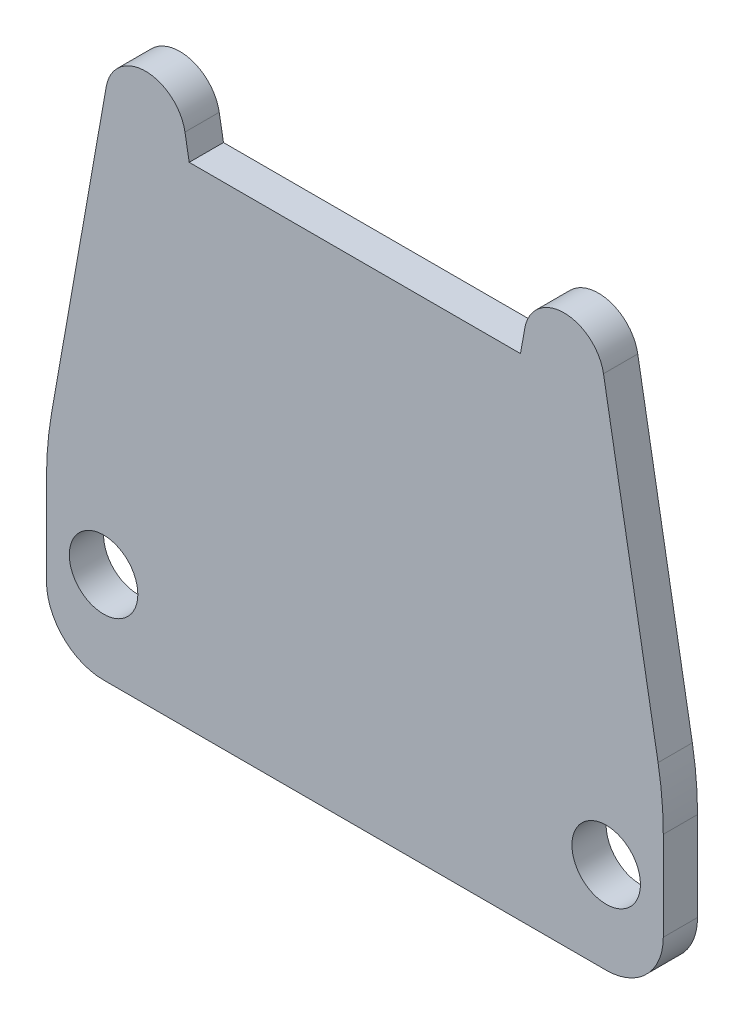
ISO-10303-21;
HEADER;
FILE_DESCRIPTION(('STEP AP214'),'2;1');
FILE_NAME('part.step','',(''),(''),'','','');
FILE_SCHEMA(('AUTOMOTIVE_DESIGN { 1 0 10303 214 1 1 1 1 }'));
ENDSEC;
DATA;
#1=APPLICATION_CONTEXT('core data for automotive mechanical design processes');
#2=APPLICATION_PROTOCOL_DEFINITION('international standard','automotive_design',2000,#1);
#3=PRODUCT_CONTEXT('',#1,'mechanical');
#4=PRODUCT('Part','Part','',(#3));
#5=PRODUCT_RELATED_PRODUCT_CATEGORY('part','',(#4));
#6=PRODUCT_DEFINITION_FORMATION('','',#4);
#7=PRODUCT_DEFINITION_CONTEXT('part definition',#1,'design');
#8=PRODUCT_DEFINITION('design','',#6,#7);
#9=PRODUCT_DEFINITION_SHAPE('','',#8);
#10=(LENGTH_UNIT() NAMED_UNIT(*) SI_UNIT(.MILLI.,.METRE.));
#11=(NAMED_UNIT(*) PLANE_ANGLE_UNIT() SI_UNIT($,.RADIAN.));
#12=(NAMED_UNIT(*) SI_UNIT($,.STERADIAN.) SOLID_ANGLE_UNIT());
#13=UNCERTAINTY_MEASURE_WITH_UNIT(LENGTH_MEASURE(1.E-05),#10,'distance_accuracy_value','');
#14=(GEOMETRIC_REPRESENTATION_CONTEXT(3) GLOBAL_UNCERTAINTY_ASSIGNED_CONTEXT((#13)) GLOBAL_UNIT_ASSIGNED_CONTEXT((#10,
#11,#12)) REPRESENTATION_CONTEXT('',''));
#15=CARTESIAN_POINT('',(0.,0.,0.));
#16=DIRECTION('',(0.,0.,1.));
#17=DIRECTION('',(1.,0.,0.));
#18=AXIS2_PLACEMENT_3D('',#15,#16,#17);
#19=CARTESIAN_POINT('',(-22.,14.8090097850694,3.));
#20=DIRECTION('',(0.,0.,1.));
#21=DIRECTION('',(1.,0.,0.));
#22=AXIS2_PLACEMENT_3D('',#19,#20,#21);
#23=PLANE('',#22);
#24=CARTESIAN_POINT('',(0.,0.,3.));
#25=DIRECTION('',(0.,0.,1.));
#26=DIRECTION('',(1.,0.,0.));
#27=AXIS2_PLACEMENT_3D('',#24,#25,#26);
#28=CIRCLE('',#27,3.);
#29=CARTESIAN_POINT('',(3.,0.,3.));
#30=VERTEX_POINT('',#29);
#31=EDGE_CURVE('E139',#30,#30,#28,.F.);
#32=ORIENTED_EDGE('',*,*,#31,.T.);
#33=EDGE_LOOP('',(#32));
#34=FACE_BOUND('',#33,.T.);
#35=CARTESIAN_POINT('',(-44.,0.,3.));
#36=DIRECTION('',(0.,0.,1.));
#37=DIRECTION('',(1.,0.,0.));
#38=AXIS2_PLACEMENT_3D('',#35,#36,#37);
#39=CIRCLE('',#38,3.);
#40=CARTESIAN_POINT('',(-41.,0.,3.));
#41=VERTEX_POINT('',#40);
#42=EDGE_CURVE('E146',#41,#41,#39,.F.);
#43=ORIENTED_EDGE('',*,*,#42,.T.);
#44=EDGE_LOOP('',(#43));
#45=FACE_BOUND('',#44,.T.);
#46=CARTESIAN_POINT('',(-25.0000007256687,4.80420494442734,3.));
#47=DIRECTION('',(0.,0.,1.));
#48=DIRECTION('',(1.,0.,0.));
#49=AXIS2_PLACEMENT_3D('',#46,#47,#48);
#50=CIRCLE('',#49,30.0000007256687);
#51=CARTESIAN_POINT('',(4.54423258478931,10.0136503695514,3.));
#52=VERTEX_POINT('',#51);
#53=CARTESIAN_POINT('',(4.99999999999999,4.80420494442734,3.));
#54=VERTEX_POINT('',#53);
#55=EDGE_CURVE('E194',#52,#54,#50,.F.);
#56=ORIENTED_EDGE('',*,*,#55,.F.);
#57=DIRECTION('',(-0.173648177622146,0.984807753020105,0.));
#58=VECTOR('',#57,1.);
#59=CARTESIAN_POINT('',(-0.233191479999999,37.10776862,3.));
#60=LINE('',#59,#58);
#61=CARTESIAN_POINT('',(-0.233191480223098,37.1077686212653,3.));
#62=VERTEX_POINT('',#61);
#63=EDGE_CURVE('E191',#62,#52,#60,.F.);
#64=ORIENTED_EDGE('',*,*,#63,.F.);
#65=CARTESIAN_POINT('',(-3.680018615,36.5000000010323,3.));
#66=DIRECTION('',(0.,0.,1.));
#67=DIRECTION('',(1.,0.,0.));
#68=AXIS2_PLACEMENT_3D('',#65,#66,#67);
#69=CIRCLE('',#68,3.49999999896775);
#70=CARTESIAN_POINT('',(-7.12684574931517,37.1077686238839,3.));
#71=VERTEX_POINT('',#70);
#72=EDGE_CURVE('E188',#71,#62,#69,.F.);
#73=ORIENTED_EDGE('',*,*,#72,.F.);
#74=DIRECTION('',(-0.173648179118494,-0.984807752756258,0.));
#75=VECTOR('',#74,1.);
#76=CARTESIAN_POINT('',(-7.49850223,35.,3.));
#77=LINE('',#76,#75);
#78=CARTESIAN_POINT('',(-7.49850223,35.,3.));
#79=VERTEX_POINT('',#78);
#80=EDGE_CURVE('E180',#79,#71,#77,.F.);
#81=ORIENTED_EDGE('',*,*,#80,.F.);
#82=DIRECTION('',(1.,0.,0.));
#83=VECTOR('',#82,1.);
#84=CARTESIAN_POINT('',(-36.50149777,35.,3.));
#85=LINE('',#84,#83);
#86=CARTESIAN_POINT('',(-36.50149777,35.,3.));
#87=VERTEX_POINT('',#86);
#88=EDGE_CURVE('E144',#87,#79,#85,.T.);
#89=ORIENTED_EDGE('',*,*,#88,.F.);
#90=DIRECTION('',(-0.173648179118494,0.984807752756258,0.));
#91=VECTOR('',#90,1.);
#92=CARTESIAN_POINT('',(-36.87315425,37.10776862,3.));
#93=LINE('',#92,#91);
#94=CARTESIAN_POINT('',(-36.8731542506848,37.1077686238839,3.));
#95=VERTEX_POINT('',#94);
#96=EDGE_CURVE('E118',#95,#87,#93,.F.);
#97=ORIENTED_EDGE('',*,*,#96,.F.);
#98=CARTESIAN_POINT('',(-40.319981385,36.5000000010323,3.));
#99=DIRECTION('',(0.,0.,1.));
#100=DIRECTION('',(1.,0.,0.));
#101=AXIS2_PLACEMENT_3D('',#98,#99,#100);
#102=CIRCLE('',#101,3.49999999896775);
#103=CARTESIAN_POINT('',(-43.7668085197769,37.1077686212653,3.));
#104=VERTEX_POINT('',#103);
#105=EDGE_CURVE('E20',#104,#95,#102,.F.);
#106=ORIENTED_EDGE('',*,*,#105,.F.);
#107=DIRECTION('',(-0.173648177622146,-0.984807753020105,0.));
#108=VECTOR('',#107,1.);
#109=CARTESIAN_POINT('',(-48.54423259,10.01365034,3.));
#110=LINE('',#109,#108);
#111=CARTESIAN_POINT('',(-48.5442325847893,10.0136503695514,3.));
#112=VERTEX_POINT('',#111);
#113=EDGE_CURVE('E107',#112,#104,#110,.F.);
#114=ORIENTED_EDGE('',*,*,#113,.F.);
#115=CARTESIAN_POINT('',(-18.9999992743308,4.80420494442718,3.));
#116=DIRECTION('',(0.,0.,1.));
#117=DIRECTION('',(1.,0.,0.));
#118=AXIS2_PLACEMENT_3D('',#115,#116,#117);
#119=CIRCLE('',#118,30.0000007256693);
#120=CARTESIAN_POINT('',(-49.,4.80420497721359,3.));
#121=VERTEX_POINT('',#120);
#122=EDGE_CURVE('E212',#121,#112,#119,.F.);
#123=ORIENTED_EDGE('',*,*,#122,.F.);
#124=DIRECTION('',(0.,1.,0.));
#125=VECTOR('',#124,1.);
#126=CARTESIAN_POINT('',(-49.,-3.00000001,3.));
#127=LINE('',#126,#125);
#128=CARTESIAN_POINT('',(-49.,-3.00000001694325,3.));
#129=VERTEX_POINT('',#128);
#130=EDGE_CURVE('E209',#129,#121,#127,.T.);
#131=ORIENTED_EDGE('',*,*,#130,.F.);
#132=CARTESIAN_POINT('',(-44.0000000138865,-3.0000000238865,3.));
#133=DIRECTION('',(0.,0.,1.));
#134=DIRECTION('',(1.,0.,0.));
#135=AXIS2_PLACEMENT_3D('',#132,#133,#134);
#136=CIRCLE('',#135,4.99999998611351);
#137=CARTESIAN_POINT('',(-44.0000000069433,-8.00000001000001,3.));
#138=VERTEX_POINT('',#137);
#139=EDGE_CURVE('E206',#138,#129,#136,.F.);
#140=ORIENTED_EDGE('',*,*,#139,.F.);
#141=DIRECTION('',(1.,0.,0.));
#142=VECTOR('',#141,1.);
#143=CARTESIAN_POINT('',(0.,-8.00000001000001,3.));
#144=LINE('',#143,#142);
#145=CARTESIAN_POINT('',(6.94326425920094E-09,-8.00000001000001,3.));
#146=VERTEX_POINT('',#145);
#147=EDGE_CURVE('E203',#146,#138,#144,.F.);
#148=ORIENTED_EDGE('',*,*,#147,.F.);
#149=CARTESIAN_POINT('',(1.3886524E-08,-3.00000002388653,3.));
#150=DIRECTION('',(0.,0.,1.));
#151=DIRECTION('',(1.,0.,0.));
#152=AXIS2_PLACEMENT_3D('',#149,#150,#151);
#153=CIRCLE('',#152,4.99999998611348);
#154=CARTESIAN_POINT('',(5.,-3.00000001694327,3.));
#155=VERTEX_POINT('',#154);
#156=EDGE_CURVE('E200',#155,#146,#153,.F.);
#157=ORIENTED_EDGE('',*,*,#156,.F.);
#158=DIRECTION('',(0.,1.,0.));
#159=VECTOR('',#158,1.);
#160=CARTESIAN_POINT('',(5.,4.80420501,3.));
#161=LINE('',#160,#159);
#162=EDGE_CURVE('E197',#54,#155,#161,.F.);
#163=ORIENTED_EDGE('',*,*,#162,.F.);
#164=EDGE_LOOP('',(#56,#64,#73,#81,#89,#97,#106,#114,#123,#131,#140,#148,#157,#163));
#165=FACE_BOUND('',#164,.T.);
#166=ADVANCED_FACE('F17',(#34,#45,#165),#23,.T.);
#167=CARTESIAN_POINT('',(-36.50149777,35.,0.));
#168=DIRECTION('',(0.,1.,0.));
#169=DIRECTION('',(0.,0.,1.));
#170=AXIS2_PLACEMENT_3D('',#167,#168,#169);
#171=PLANE('',#170);
#172=DIRECTION('',(1.,0.,0.));
#173=VECTOR('',#172,1.);
#174=CARTESIAN_POINT('',(-22.,35.,0.));
#175=LINE('',#174,#173);
#176=CARTESIAN_POINT('',(-7.49850223,35.,0.));
#177=VERTEX_POINT('',#176);
#178=CARTESIAN_POINT('',(-36.50149777,35.,0.));
#179=VERTEX_POINT('',#178);
#180=EDGE_CURVE('E128',#177,#179,#175,.F.);
#181=ORIENTED_EDGE('',*,*,#180,.T.);
#182=DIRECTION('',(0.,0.,1.));
#183=VECTOR('',#182,1.);
#184=CARTESIAN_POINT('',(-36.50149777,35.,0.));
#185=LINE('',#184,#183);
#186=EDGE_CURVE('E217',#87,#179,#185,.F.);
#187=ORIENTED_EDGE('',*,*,#186,.F.);
#188=ORIENTED_EDGE('',*,*,#88,.T.);
#189=DIRECTION('',(0.,0.,1.));
#190=VECTOR('',#189,1.);
#191=CARTESIAN_POINT('',(-7.49850223,35.,0.));
#192=LINE('',#191,#190);
#193=EDGE_CURVE('E142',#177,#79,#192,.T.);
#194=ORIENTED_EDGE('',*,*,#193,.F.);
#195=EDGE_LOOP('',(#181,#187,#188,#194));
#196=FACE_BOUND('',#195,.T.);
#197=ADVANCED_FACE('F143',(#196),#171,.T.);
#198=CARTESIAN_POINT('',(-36.87315425,37.10776862,0.));
#199=DIRECTION('',(0.984807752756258,0.173648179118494,0.));
#200=DIRECTION('',(-0.173648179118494,0.984807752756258,0.));
#201=AXIS2_PLACEMENT_3D('',#198,#199,#200);
#202=PLANE('',#201);
#203=DIRECTION('',(-0.173648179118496,0.984807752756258,0.));
#204=VECTOR('',#203,1.);
#205=CARTESIAN_POINT('',(-36.50149777,35.,0.));
#206=LINE('',#205,#204);
#207=CARTESIAN_POINT('',(-36.8731542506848,37.1077686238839,0.));
#208=VERTEX_POINT('',#207);
#209=EDGE_CURVE('E136',#179,#208,#206,.T.);
#210=ORIENTED_EDGE('',*,*,#209,.T.);
#211=DIRECTION('',(0.,0.,1.));
#212=VECTOR('',#211,1.);
#213=CARTESIAN_POINT('',(-36.87315425,37.10776862,0.));
#214=LINE('',#213,#212);
#215=EDGE_CURVE('E215',#95,#208,#214,.F.);
#216=ORIENTED_EDGE('',*,*,#215,.F.);
#217=ORIENTED_EDGE('',*,*,#96,.T.);
#218=ORIENTED_EDGE('',*,*,#186,.T.);
#219=EDGE_LOOP('',(#210,#216,#217,#218));
#220=FACE_BOUND('',#219,.T.);
#221=ADVANCED_FACE('F264',(#220),#202,.T.);
#222=CARTESIAN_POINT('',(-40.319981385,36.5000000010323,0.));
#223=DIRECTION('',(0.,0.,1.));
#224=DIRECTION('',(1.,0.,0.));
#225=AXIS2_PLACEMENT_3D('',#222,#223,#224);
#226=CYLINDRICAL_SURFACE('',#225,3.49999999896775);
#227=CARTESIAN_POINT('',(-40.319981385,36.5000000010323,0.));
#228=DIRECTION('',(0.,0.,1.));
#229=DIRECTION('',(1.,0.,0.));
#230=AXIS2_PLACEMENT_3D('',#227,#228,#229);
#231=CIRCLE('',#230,3.49999999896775);
#232=CARTESIAN_POINT('',(-43.7668085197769,37.1077686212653,0.));
#233=VERTEX_POINT('',#232);
#234=EDGE_CURVE('E176',#208,#233,#231,.T.);
#235=ORIENTED_EDGE('',*,*,#234,.T.);
#236=DIRECTION('',(0.,0.,1.));
#237=VECTOR('',#236,1.);
#238=CARTESIAN_POINT('',(-43.76680852,37.10776862,0.));
#239=LINE('',#238,#237);
#240=EDGE_CURVE('E213',#104,#233,#239,.F.);
#241=ORIENTED_EDGE('',*,*,#240,.F.);
#242=ORIENTED_EDGE('',*,*,#105,.T.);
#243=ORIENTED_EDGE('',*,*,#215,.T.);
#244=EDGE_LOOP('',(#235,#241,#242,#243));
#245=FACE_BOUND('',#244,.T.);
#246=ADVANCED_FACE('F263',(#245),#226,.T.);
#247=CARTESIAN_POINT('',(-48.54423259,10.01365034,0.));
#248=DIRECTION('',(-0.984807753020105,0.173648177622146,0.));
#249=DIRECTION('',(-0.173648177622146,-0.984807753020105,0.));
#250=AXIS2_PLACEMENT_3D('',#247,#248,#249);
#251=PLANE('',#250);
#252=DIRECTION('',(-0.173648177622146,-0.984807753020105,0.));
#253=VECTOR('',#252,1.);
#254=CARTESIAN_POINT('',(-43.76680852,37.10776862,0.));
#255=LINE('',#254,#253);
#256=CARTESIAN_POINT('',(-48.5442325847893,10.0136503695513,0.));
#257=VERTEX_POINT('',#256);
#258=EDGE_CURVE('E173',#233,#257,#255,.T.);
#259=ORIENTED_EDGE('',*,*,#258,.T.);
#260=DIRECTION('',(0.,0.,1.));
#261=VECTOR('',#260,1.);
#262=CARTESIAN_POINT('',(-48.54423259,10.01365034,0.));
#263=LINE('',#262,#261);
#264=EDGE_CURVE('E210',#112,#257,#263,.F.);
#265=ORIENTED_EDGE('',*,*,#264,.F.);
#266=ORIENTED_EDGE('',*,*,#113,.T.);
#267=ORIENTED_EDGE('',*,*,#240,.T.);
#268=EDGE_LOOP('',(#259,#265,#266,#267));
#269=FACE_BOUND('',#268,.T.);
#270=ADVANCED_FACE('F260',(#269),#251,.T.);
#271=CARTESIAN_POINT('',(-18.9999992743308,4.80420494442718,0.));
#272=DIRECTION('',(0.,0.,1.));
#273=DIRECTION('',(1.,0.,0.));
#274=AXIS2_PLACEMENT_3D('',#271,#272,#273);
#275=CYLINDRICAL_SURFACE('',#274,30.0000007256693);
#276=CARTESIAN_POINT('',(-18.9999992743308,4.80420494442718,0.));
#277=DIRECTION('',(0.,0.,1.));
#278=DIRECTION('',(1.,0.,0.));
#279=AXIS2_PLACEMENT_3D('',#276,#277,#278);
#280=CIRCLE('',#279,30.0000007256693);
#281=CARTESIAN_POINT('',(-49.,4.80420497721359,0.));
#282=VERTEX_POINT('',#281);
#283=EDGE_CURVE('E172',#257,#282,#280,.T.);
#284=ORIENTED_EDGE('',*,*,#283,.T.);
#285=DIRECTION('',(0.,0.,1.));
#286=VECTOR('',#285,1.);
#287=CARTESIAN_POINT('',(-49.,4.80420501,0.));
#288=LINE('',#287,#286);
#289=EDGE_CURVE('E207',#121,#282,#288,.F.);
#290=ORIENTED_EDGE('',*,*,#289,.F.);
#291=ORIENTED_EDGE('',*,*,#122,.T.);
#292=ORIENTED_EDGE('',*,*,#264,.T.);
#293=EDGE_LOOP('',(#284,#290,#291,#292));
#294=FACE_BOUND('',#293,.T.);
#295=ADVANCED_FACE('F255',(#294),#275,.T.);
#296=CARTESIAN_POINT('',(-49.,-3.00000001,0.));
#297=DIRECTION('',(-1.,0.,0.));
#298=DIRECTION('',(0.,0.,1.));
#299=AXIS2_PLACEMENT_3D('',#296,#297,#298);
#300=PLANE('',#299);
#301=DIRECTION('',(0.,1.,0.));
#302=VECTOR('',#301,1.);
#303=CARTESIAN_POINT('',(-49.,14.8090097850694,0.));
#304=LINE('',#303,#302);
#305=CARTESIAN_POINT('',(-49.,-3.00000001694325,0.));
#306=VERTEX_POINT('',#305);
#307=EDGE_CURVE('E169',#282,#306,#304,.F.);
#308=ORIENTED_EDGE('',*,*,#307,.T.);
#309=DIRECTION('',(0.,0.,1.));
#310=VECTOR('',#309,1.);
#311=CARTESIAN_POINT('',(-49.,-3.00000001,0.));
#312=LINE('',#311,#310);
#313=EDGE_CURVE('E204',#129,#306,#312,.F.);
#314=ORIENTED_EDGE('',*,*,#313,.F.);
#315=ORIENTED_EDGE('',*,*,#130,.T.);
#316=ORIENTED_EDGE('',*,*,#289,.T.);
#317=EDGE_LOOP('',(#308,#314,#315,#316));
#318=FACE_BOUND('',#317,.T.);
#319=ADVANCED_FACE('F318',(#318),#300,.T.);
#320=CARTESIAN_POINT('',(-44.0000000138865,-3.0000000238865,0.));
#321=DIRECTION('',(0.,0.,1.));
#322=DIRECTION('',(1.,0.,0.));
#323=AXIS2_PLACEMENT_3D('',#320,#321,#322);
#324=CYLINDRICAL_SURFACE('',#323,4.99999998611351);
#325=CARTESIAN_POINT('',(-44.0000000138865,-3.0000000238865,0.));
#326=DIRECTION('',(0.,0.,1.));
#327=DIRECTION('',(1.,0.,0.));
#328=AXIS2_PLACEMENT_3D('',#325,#326,#327);
#329=CIRCLE('',#328,4.99999998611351);
#330=CARTESIAN_POINT('',(-44.0000000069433,-8.00000001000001,0.));
#331=VERTEX_POINT('',#330);
#332=EDGE_CURVE('E168',#306,#331,#329,.T.);
#333=ORIENTED_EDGE('',*,*,#332,.T.);
#334=DIRECTION('',(0.,0.,-1.));
#335=VECTOR('',#334,1.);
#336=CARTESIAN_POINT('',(-44.,-8.00000001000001,0.));
#337=LINE('',#336,#335);
#338=EDGE_CURVE('E201',#138,#331,#337,.T.);
#339=ORIENTED_EDGE('',*,*,#338,.F.);
#340=ORIENTED_EDGE('',*,*,#139,.T.);
#341=ORIENTED_EDGE('',*,*,#313,.T.);
#342=EDGE_LOOP('',(#333,#339,#340,#341));
#343=FACE_BOUND('',#342,.T.);
#344=ADVANCED_FACE('F314',(#343),#324,.T.);
#345=CARTESIAN_POINT('',(0.,-8.00000001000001,0.));
#346=DIRECTION('',(0.,-1.,0.));
#347=DIRECTION('',(0.,0.,-1.));
#348=AXIS2_PLACEMENT_3D('',#345,#346,#347);
#349=PLANE('',#348);
#350=DIRECTION('',(1.,0.,0.));
#351=VECTOR('',#350,1.);
#352=CARTESIAN_POINT('',(-22.,-8.00000001,0.));
#353=LINE('',#352,#351);
#354=CARTESIAN_POINT('',(6.94326399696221E-09,-8.00000001,0.));
#355=VERTEX_POINT('',#354);
#356=EDGE_CURVE('E165',#331,#355,#353,.T.);
#357=ORIENTED_EDGE('',*,*,#356,.T.);
#358=DIRECTION('',(0.,0.,1.));
#359=VECTOR('',#358,1.);
#360=CARTESIAN_POINT('',(0.,-8.00000001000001,0.));
#361=LINE('',#360,#359);
#362=EDGE_CURVE('E198',#146,#355,#361,.F.);
#363=ORIENTED_EDGE('',*,*,#362,.F.);
#364=ORIENTED_EDGE('',*,*,#147,.T.);
#365=ORIENTED_EDGE('',*,*,#338,.T.);
#366=EDGE_LOOP('',(#357,#363,#364,#365));
#367=FACE_BOUND('',#366,.T.);
#368=ADVANCED_FACE('F310',(#367),#349,.T.);
#369=CARTESIAN_POINT('',(1.3886524E-08,-3.00000002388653,0.));
#370=DIRECTION('',(0.,0.,1.));
#371=DIRECTION('',(1.,0.,0.));
#372=AXIS2_PLACEMENT_3D('',#369,#370,#371);
#373=CYLINDRICAL_SURFACE('',#372,4.99999998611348);
#374=CARTESIAN_POINT('',(1.3886524E-08,-3.00000002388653,0.));
#375=DIRECTION('',(0.,0.,1.));
#376=DIRECTION('',(1.,0.,0.));
#377=AXIS2_PLACEMENT_3D('',#374,#375,#376);
#378=CIRCLE('',#377,4.99999998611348);
#379=CARTESIAN_POINT('',(5.,-3.00000001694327,0.));
#380=VERTEX_POINT('',#379);
#381=EDGE_CURVE('E164',#355,#380,#378,.T.);
#382=ORIENTED_EDGE('',*,*,#381,.T.);
#383=DIRECTION('',(0.,0.,-1.));
#384=VECTOR('',#383,1.);
#385=CARTESIAN_POINT('',(5.,-3.00000001,0.));
#386=LINE('',#385,#384);
#387=EDGE_CURVE('E195',#155,#380,#386,.T.);
#388=ORIENTED_EDGE('',*,*,#387,.F.);
#389=ORIENTED_EDGE('',*,*,#156,.T.);
#390=ORIENTED_EDGE('',*,*,#362,.T.);
#391=EDGE_LOOP('',(#382,#388,#389,#390));
#392=FACE_BOUND('',#391,.T.);
#393=ADVANCED_FACE('F306',(#392),#373,.T.);
#394=CARTESIAN_POINT('',(5.,4.80420501,0.));
#395=DIRECTION('',(1.,0.,0.));
#396=DIRECTION('',(0.,0.,-1.));
#397=AXIS2_PLACEMENT_3D('',#394,#395,#396);
#398=PLANE('',#397);
#399=DIRECTION('',(0.,1.,0.));
#400=VECTOR('',#399,1.);
#401=CARTESIAN_POINT('',(5.,14.8090097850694,0.));
#402=LINE('',#401,#400);
#403=CARTESIAN_POINT('',(5.,4.80420494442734,0.));
#404=VERTEX_POINT('',#403);
#405=EDGE_CURVE('E161',#380,#404,#402,.T.);
#406=ORIENTED_EDGE('',*,*,#405,.T.);
#407=DIRECTION('',(0.,0.,1.));
#408=VECTOR('',#407,1.);
#409=CARTESIAN_POINT('',(4.99999999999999,4.80420494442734,0.));
#410=LINE('',#409,#408);
#411=EDGE_CURVE('E192',#54,#404,#410,.F.);
#412=ORIENTED_EDGE('',*,*,#411,.F.);
#413=ORIENTED_EDGE('',*,*,#162,.T.);
#414=ORIENTED_EDGE('',*,*,#387,.T.);
#415=EDGE_LOOP('',(#406,#412,#413,#414));
#416=FACE_BOUND('',#415,.T.);
#417=ADVANCED_FACE('F302',(#416),#398,.T.);
#418=CARTESIAN_POINT('',(-25.0000007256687,4.80420494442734,0.));
#419=DIRECTION('',(0.,0.,1.));
#420=DIRECTION('',(1.,0.,0.));
#421=AXIS2_PLACEMENT_3D('',#418,#419,#420);
#422=CYLINDRICAL_SURFACE('',#421,30.0000007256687);
#423=CARTESIAN_POINT('',(-25.0000007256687,4.80420494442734,0.));
#424=DIRECTION('',(0.,0.,1.));
#425=DIRECTION('',(1.,0.,0.));
#426=AXIS2_PLACEMENT_3D('',#423,#424,#425);
#427=CIRCLE('',#426,30.0000007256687);
#428=CARTESIAN_POINT('',(4.54423258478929,10.0136503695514,0.));
#429=VERTEX_POINT('',#428);
#430=EDGE_CURVE('E160',#404,#429,#427,.T.);
#431=ORIENTED_EDGE('',*,*,#430,.T.);
#432=DIRECTION('',(0.,0.,1.));
#433=VECTOR('',#432,1.);
#434=CARTESIAN_POINT('',(4.54423259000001,10.01365034,0.));
#435=LINE('',#434,#433);
#436=EDGE_CURVE('E189',#52,#429,#435,.F.);
#437=ORIENTED_EDGE('',*,*,#436,.F.);
#438=ORIENTED_EDGE('',*,*,#55,.T.);
#439=ORIENTED_EDGE('',*,*,#411,.T.);
#440=EDGE_LOOP('',(#431,#437,#438,#439));
#441=FACE_BOUND('',#440,.T.);
#442=ADVANCED_FACE('F298',(#441),#422,.T.);
#443=CARTESIAN_POINT('',(-0.233191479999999,37.10776862,0.));
#444=DIRECTION('',(0.984807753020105,0.173648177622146,0.));
#445=DIRECTION('',(-0.173648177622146,0.984807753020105,0.));
#446=AXIS2_PLACEMENT_3D('',#443,#444,#445);
#447=PLANE('',#446);
#448=DIRECTION('',(-0.173648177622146,0.984807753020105,0.));
#449=VECTOR('',#448,1.);
#450=CARTESIAN_POINT('',(4.54423259,10.01365034,0.));
#451=LINE('',#450,#449);
#452=CARTESIAN_POINT('',(-0.233191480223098,37.1077686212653,0.));
#453=VERTEX_POINT('',#452);
#454=EDGE_CURVE('E153',#429,#453,#451,.T.);
#455=ORIENTED_EDGE('',*,*,#454,.T.);
#456=DIRECTION('',(0.,0.,1.));
#457=VECTOR('',#456,1.);
#458=CARTESIAN_POINT('',(-0.233191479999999,37.10776862,0.));
#459=LINE('',#458,#457);
#460=EDGE_CURVE('E186',#62,#453,#459,.F.);
#461=ORIENTED_EDGE('',*,*,#460,.F.);
#462=ORIENTED_EDGE('',*,*,#63,.T.);
#463=ORIENTED_EDGE('',*,*,#436,.T.);
#464=EDGE_LOOP('',(#455,#461,#462,#463));
#465=FACE_BOUND('',#464,.T.);
#466=ADVANCED_FACE('F294',(#465),#447,.T.);
#467=CARTESIAN_POINT('',(-3.680018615,36.5000000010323,0.));
#468=DIRECTION('',(0.,0.,1.));
#469=DIRECTION('',(1.,0.,0.));
#470=AXIS2_PLACEMENT_3D('',#467,#468,#469);
#471=CYLINDRICAL_SURFACE('',#470,3.49999999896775);
#472=CARTESIAN_POINT('',(-3.680018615,36.5000000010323,0.));
#473=DIRECTION('',(0.,0.,1.));
#474=DIRECTION('',(1.,0.,0.));
#475=AXIS2_PLACEMENT_3D('',#472,#473,#474);
#476=CIRCLE('',#475,3.49999999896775);
#477=CARTESIAN_POINT('',(-7.12684574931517,37.1077686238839,0.));
#478=VERTEX_POINT('',#477);
#479=EDGE_CURVE('E149',#453,#478,#476,.T.);
#480=ORIENTED_EDGE('',*,*,#479,.T.);
#481=DIRECTION('',(0.,0.,1.));
#482=VECTOR('',#481,1.);
#483=CARTESIAN_POINT('',(-7.12684575,37.10776862,0.));
#484=LINE('',#483,#482);
#485=EDGE_CURVE('E35',#71,#478,#484,.F.);
#486=ORIENTED_EDGE('',*,*,#485,.F.);
#487=ORIENTED_EDGE('',*,*,#72,.T.);
#488=ORIENTED_EDGE('',*,*,#460,.T.);
#489=EDGE_LOOP('',(#480,#486,#487,#488));
#490=FACE_BOUND('',#489,.T.);
#491=ADVANCED_FACE('F291',(#490),#471,.T.);
#492=CARTESIAN_POINT('',(-7.49850223,35.,0.));
#493=DIRECTION('',(-0.984807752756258,0.173648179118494,0.));
#494=DIRECTION('',(-0.173648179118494,-0.984807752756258,0.));
#495=AXIS2_PLACEMENT_3D('',#492,#493,#494);
#496=PLANE('',#495);
#497=DIRECTION('',(-0.173648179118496,-0.984807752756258,0.));
#498=VECTOR('',#497,1.);
#499=CARTESIAN_POINT('',(-7.12684575,37.10776862,0.));
#500=LINE('',#499,#498);
#501=EDGE_CURVE('E132',#478,#177,#500,.T.);
#502=ORIENTED_EDGE('',*,*,#501,.T.);
#503=ORIENTED_EDGE('',*,*,#193,.T.);
#504=ORIENTED_EDGE('',*,*,#80,.T.);
#505=ORIENTED_EDGE('',*,*,#485,.T.);
#506=EDGE_LOOP('',(#502,#503,#504,#505));
#507=FACE_BOUND('',#506,.T.);
#508=ADVANCED_FACE('F148',(#507),#496,.T.);
#509=CARTESIAN_POINT('',(-44.,0.,1.5));
#510=DIRECTION('',(0.,0.,1.));
#511=DIRECTION('',(1.,0.,0.));
#512=AXIS2_PLACEMENT_3D('',#509,#510,#511);
#513=CYLINDRICAL_SURFACE('',#512,3.);
#514=ORIENTED_EDGE('',*,*,#42,.F.);
#515=EDGE_LOOP('',(#514));
#516=FACE_BOUND('',#515,.T.);
#517=CARTESIAN_POINT('',(-44.,0.,0.));
#518=DIRECTION('',(0.,0.,1.));
#519=DIRECTION('',(1.,0.,0.));
#520=AXIS2_PLACEMENT_3D('',#517,#518,#519);
#521=CIRCLE('',#520,3.);
#522=CARTESIAN_POINT('',(-41.,0.,0.));
#523=VERTEX_POINT('',#522);
#524=EDGE_CURVE('E26',#523,#523,#521,.F.);
#525=ORIENTED_EDGE('',*,*,#524,.T.);
#526=EDGE_LOOP('',(#525));
#527=FACE_BOUND('',#526,.T.);
#528=ADVANCED_FACE('F280',(#516,#527),#513,.F.);
#529=CARTESIAN_POINT('',(0.,0.,1.5));
#530=DIRECTION('',(0.,0.,1.));
#531=DIRECTION('',(1.,0.,0.));
#532=AXIS2_PLACEMENT_3D('',#529,#530,#531);
#533=CYLINDRICAL_SURFACE('',#532,3.);
#534=ORIENTED_EDGE('',*,*,#31,.F.);
#535=EDGE_LOOP('',(#534));
#536=FACE_BOUND('',#535,.T.);
#537=CARTESIAN_POINT('',(0.,0.,0.));
#538=DIRECTION('',(0.,0.,1.));
#539=DIRECTION('',(1.,0.,0.));
#540=AXIS2_PLACEMENT_3D('',#537,#538,#539);
#541=CIRCLE('',#540,3.);
#542=CARTESIAN_POINT('',(3.,0.,0.));
#543=VERTEX_POINT('',#542);
#544=EDGE_CURVE('E11',#543,#543,#541,.F.);
#545=ORIENTED_EDGE('',*,*,#544,.T.);
#546=EDGE_LOOP('',(#545));
#547=FACE_BOUND('',#546,.T.);
#548=ADVANCED_FACE('F274',(#536,#547),#533,.F.);
#549=CARTESIAN_POINT('',(-22.,14.8090097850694,0.));
#550=DIRECTION('',(0.,0.,1.));
#551=DIRECTION('',(1.,0.,0.));
#552=AXIS2_PLACEMENT_3D('',#549,#550,#551);
#553=PLANE('',#552);
#554=ORIENTED_EDGE('',*,*,#544,.F.);
#555=EDGE_LOOP('',(#554));
#556=FACE_BOUND('',#555,.T.);
#557=ORIENTED_EDGE('',*,*,#524,.F.);
#558=EDGE_LOOP('',(#557));
#559=FACE_BOUND('',#558,.T.);
#560=ORIENTED_EDGE('',*,*,#479,.F.);
#561=ORIENTED_EDGE('',*,*,#454,.F.);
#562=ORIENTED_EDGE('',*,*,#430,.F.);
#563=ORIENTED_EDGE('',*,*,#405,.F.);
#564=ORIENTED_EDGE('',*,*,#381,.F.);
#565=ORIENTED_EDGE('',*,*,#356,.F.);
#566=ORIENTED_EDGE('',*,*,#332,.F.);
#567=ORIENTED_EDGE('',*,*,#307,.F.);
#568=ORIENTED_EDGE('',*,*,#283,.F.);
#569=ORIENTED_EDGE('',*,*,#258,.F.);
#570=ORIENTED_EDGE('',*,*,#234,.F.);
#571=ORIENTED_EDGE('',*,*,#209,.F.);
#572=ORIENTED_EDGE('',*,*,#180,.F.);
#573=ORIENTED_EDGE('',*,*,#501,.F.);
#574=EDGE_LOOP('',(#560,#561,#562,#563,#564,#565,#566,#567,#568,#569,#570,#571,#572,#573));
#575=FACE_BOUND('',#574,.T.);
#576=ADVANCED_FACE('F131',(#556,#559,#575),#553,.F.);
#577=CLOSED_SHELL('',(#166,#197,#221,#246,#270,#295,#319,#344,#368,#393,#417,#442,#466,#491,
#508,#528,#548,#576));
#578=MANIFOLD_SOLID_BREP('B1',#577);
#579=ADVANCED_BREP_SHAPE_REPRESENTATION('',(#18,#578),#14);
#580=SHAPE_DEFINITION_REPRESENTATION(#9,#579);
ENDSEC;
END-ISO-10303-21;
